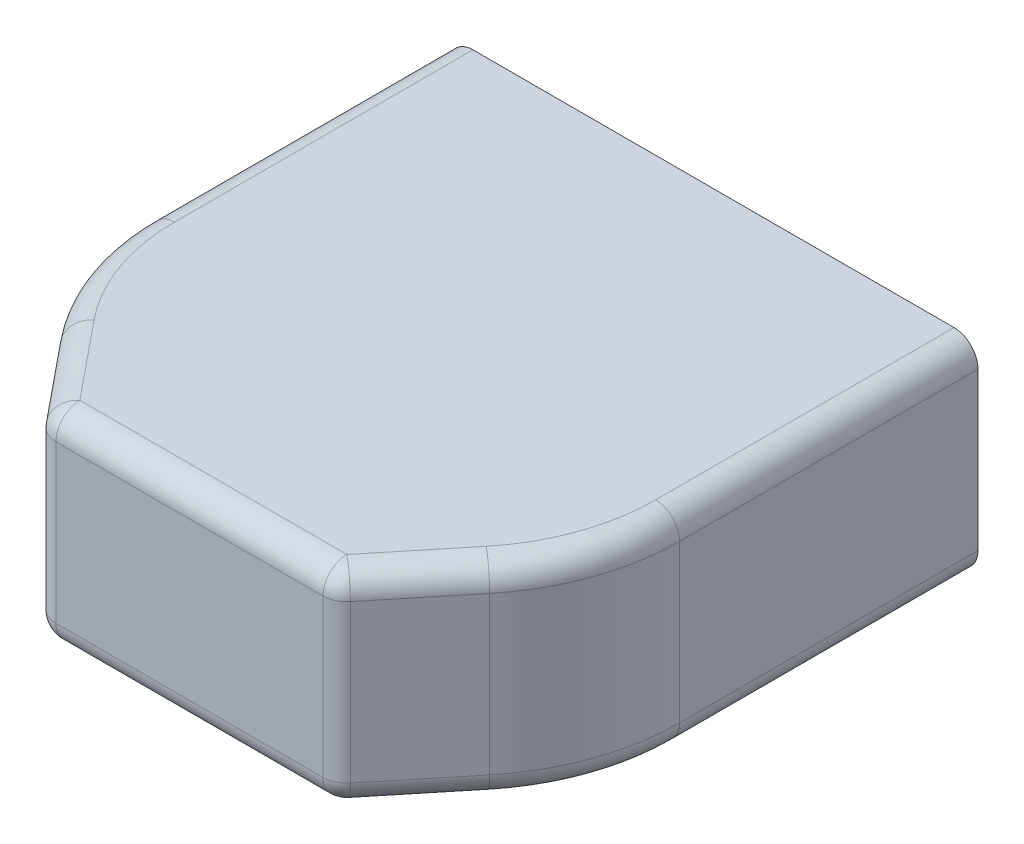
from build123d import *

# Parameters (mm, degrees)
EXTRUDE1_DEPTH = 86.941698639
FILLET1_R      = 93.98
FILLET2_R      = 10.16
FILLET3_R      = 10.16
SHELL1_T       = -5.663383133


with BuildPart() as part:
    # Sketch1 → Extrude1 (new body)
    with BuildSketch(Plane(origin=(0, 0, 0), x_dir=(1, 0, 0), z_dir=(0, 1, 0))):
        Polygon((61.41960742, 0), (-61.41960742, 0), (-112.142211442, 62.207188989), (-112.142211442, 222.168532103), (112.142211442, 222.168532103), (112.142211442, 62.207188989), align=None)
    extrude(amount=EXTRUDE1_DEPTH)

    # Fillet1
    fillet1_edges = [part.edges().sort_by_distance(p)[0] for p in [
        (112.142211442, 43.47084932, -62.207188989),
        (-112.142211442, 43.47084932, -62.207188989),
    ]]
    fillet(fillet1_edges, radius=FILLET1_R)

    # Fillet2
    fillet2_edges = [part.edges().sort_by_distance(p)[0] for p in [
        (61.41960742, 43.47084932, 0),
        (-61.41960742, 43.47084932, 0),
    ]]
    fillet(fillet2_edges, radius=FILLET2_R)

    # Fillet3
    fillet3_edges = [part.edges().sort_by_distance(p)[0] for p in [
        (112.142211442, 0, -158.917092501),
        (112.142211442, 86.941698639, -158.917092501),
        (-77.733657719, 0, -20.007868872),
        (-106.698648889, 0, -64.145189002),
        (106.698648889, 0, -64.145189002),
        (-77.733657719, 86.941698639, -20.007868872),
        (-106.698648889, 86.941698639, -64.145189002),
        (106.698648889, 86.941698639, -64.145189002),
        (0, 0, 0),
        (0, 86.941698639, 0),
        (77.733657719, 0, -20.007868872),
        (60.953070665, 0, -0.982373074),
        (-60.953070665, 0, -0.982373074),
        (77.733657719, 86.941698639, -20.007868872),
        (60.953070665, 86.941698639, -0.982373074),
        (-60.953070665, 86.941698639, -0.982373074),
        (-112.142211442, 86.941698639, -158.917092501),
        (-112.142211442, 0, -158.917092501),
    ]]
    fillet(fillet3_edges, radius=FILLET3_R)

    # Shell1
    shell1_openings = [part.faces().sort_by_distance(p)[0] for p in [
        (0, 43.47084932, -222.168532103),
    ]]
    offset(amount=SHELL1_T, openings=shell1_openings, kind=Kind.INTERSECTION)


solid = part.part
